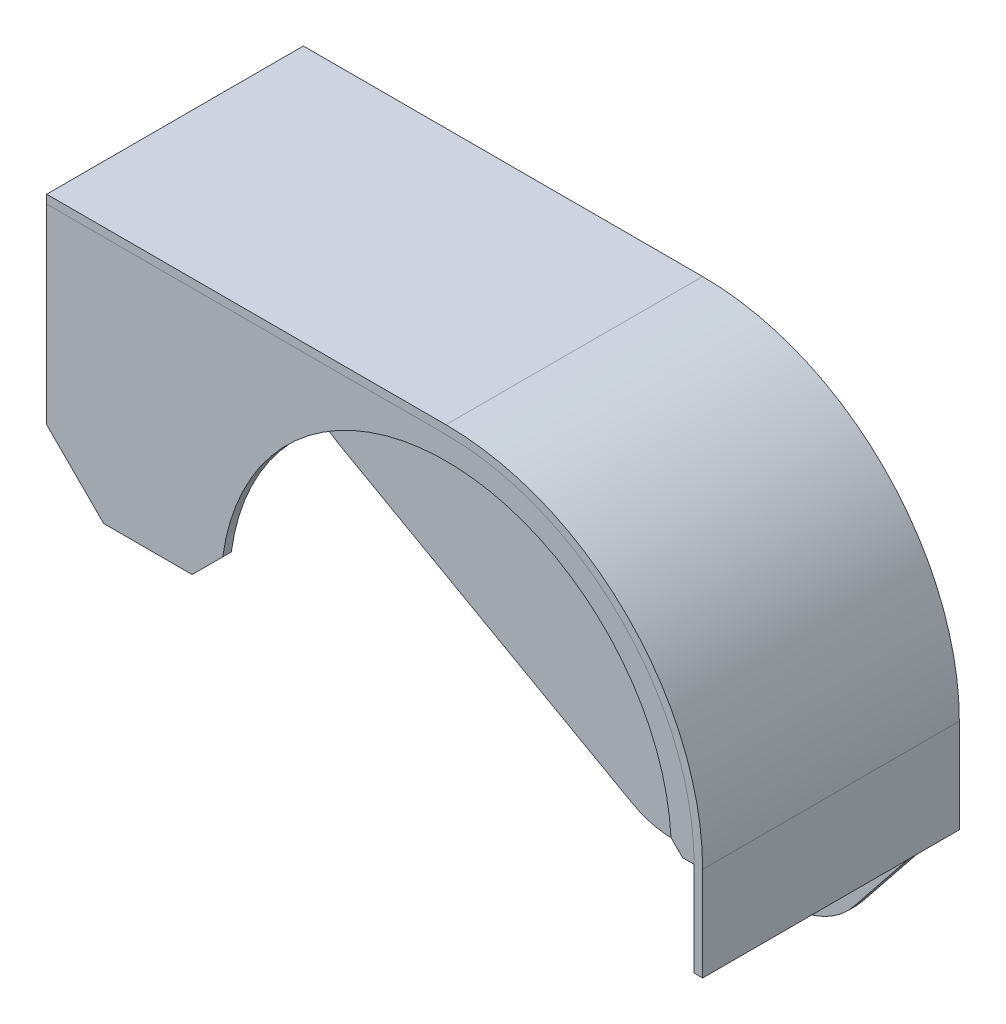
ISO-10303-21;
HEADER;
FILE_DESCRIPTION(('STEP AP214'),'2;1');
FILE_NAME('part.step','',(''),(''),'','','');
FILE_SCHEMA(('AUTOMOTIVE_DESIGN { 1 0 10303 214 1 1 1 1 }'));
ENDSEC;
DATA;
#1=APPLICATION_CONTEXT('core data for automotive mechanical design processes');
#2=APPLICATION_PROTOCOL_DEFINITION('international standard','automotive_design',2000,#1);
#3=PRODUCT_CONTEXT('',#1,'mechanical');
#4=PRODUCT('Part','Part','',(#3));
#5=PRODUCT_RELATED_PRODUCT_CATEGORY('part','',(#4));
#6=PRODUCT_DEFINITION_FORMATION('','',#4);
#7=PRODUCT_DEFINITION_CONTEXT('part definition',#1,'design');
#8=PRODUCT_DEFINITION('design','',#6,#7);
#9=PRODUCT_DEFINITION_SHAPE('','',#8);
#10=(LENGTH_UNIT() NAMED_UNIT(*) SI_UNIT(.MILLI.,.METRE.));
#11=(NAMED_UNIT(*) PLANE_ANGLE_UNIT() SI_UNIT($,.RADIAN.));
#12=(NAMED_UNIT(*) SI_UNIT($,.STERADIAN.) SOLID_ANGLE_UNIT());
#13=UNCERTAINTY_MEASURE_WITH_UNIT(LENGTH_MEASURE(1.E-05),#10,'distance_accuracy_value','');
#14=(GEOMETRIC_REPRESENTATION_CONTEXT(3) GLOBAL_UNCERTAINTY_ASSIGNED_CONTEXT((#13)) GLOBAL_UNIT_ASSIGNED_CONTEXT((#10,
#11,#12)) REPRESENTATION_CONTEXT('',''));
#15=CARTESIAN_POINT('',(0.,0.,0.));
#16=DIRECTION('',(0.,0.,1.));
#17=DIRECTION('',(1.,0.,0.));
#18=AXIS2_PLACEMENT_3D('',#15,#16,#17);
#19=CARTESIAN_POINT('',(-137.,87.,84.));
#20=DIRECTION('',(0.,0.,1.));
#21=DIRECTION('',(1.,0.,0.));
#22=AXIS2_PLACEMENT_3D('',#19,#20,#21);
#23=PLANE('',#22);
#24=DIRECTION('',(0.,1.,0.));
#25=VECTOR('',#24,1.);
#26=CARTESIAN_POINT('',(-140.,87.,84.));
#27=LINE('',#26,#25);
#28=CARTESIAN_POINT('',(-140.,62.,84.));
#29=VERTEX_POINT('',#28);
#30=CARTESIAN_POINT('',(-140.,87.,84.));
#31=VERTEX_POINT('',#30);
#32=EDGE_CURVE('E84',#29,#31,#27,.T.);
#33=ORIENTED_EDGE('',*,*,#32,.F.);
#34=DIRECTION('',(-1.,0.,0.));
#35=VECTOR('',#34,1.);
#36=CARTESIAN_POINT('',(-137.,62.,84.));
#37=LINE('',#36,#35);
#38=CARTESIAN_POINT('',(-137.,62.,84.));
#39=VERTEX_POINT('',#38);
#40=EDGE_CURVE('E12',#39,#29,#37,.T.);
#41=ORIENTED_EDGE('',*,*,#40,.F.);
#42=DIRECTION('',(0.,1.,0.));
#43=VECTOR('',#42,1.);
#44=CARTESIAN_POINT('',(-137.,87.,84.));
#45=LINE('',#44,#43);
#46=CARTESIAN_POINT('',(-137.,87.,84.));
#47=VERTEX_POINT('',#46);
#48=EDGE_CURVE('E86',#39,#47,#45,.T.);
#49=ORIENTED_EDGE('',*,*,#48,.T.);
#50=DIRECTION('',(-1.,0.,0.));
#51=VECTOR('',#50,1.);
#52=CARTESIAN_POINT('',(-137.,87.,84.));
#53=LINE('',#52,#51);
#54=EDGE_CURVE('E47',#47,#31,#53,.T.);
#55=ORIENTED_EDGE('',*,*,#54,.T.);
#56=EDGE_LOOP('',(#33,#41,#49,#55));
#57=FACE_BOUND('',#56,.T.);
#58=ADVANCED_FACE('F44',(#57),#23,.T.);
#59=CARTESIAN_POINT('',(-137.,62.,84.));
#60=DIRECTION('',(0.,-1.,0.));
#61=DIRECTION('',(0.,0.,-1.));
#62=AXIS2_PLACEMENT_3D('',#59,#60,#61);
#63=PLANE('',#62);
#64=DIRECTION('',(0.,0.,1.));
#65=VECTOR('',#64,1.);
#66=CARTESIAN_POINT('',(-140.,62.,84.));
#67=LINE('',#66,#65);
#68=CARTESIAN_POINT('',(-140.,62.,0.));
#69=VERTEX_POINT('',#68);
#70=EDGE_CURVE('E101',#69,#29,#67,.T.);
#71=ORIENTED_EDGE('',*,*,#70,.F.);
#72=DIRECTION('',(-1.,0.,0.));
#73=VECTOR('',#72,1.);
#74=CARTESIAN_POINT('',(-137.,62.,0.));
#75=LINE('',#74,#73);
#76=CARTESIAN_POINT('',(-137.,62.,0.));
#77=VERTEX_POINT('',#76);
#78=EDGE_CURVE('E52',#77,#69,#75,.T.);
#79=ORIENTED_EDGE('',*,*,#78,.F.);
#80=DIRECTION('',(0.,0.,1.));
#81=VECTOR('',#80,1.);
#82=CARTESIAN_POINT('',(-137.,62.,84.));
#83=LINE('',#82,#81);
#84=EDGE_CURVE('E91',#77,#39,#83,.T.);
#85=ORIENTED_EDGE('',*,*,#84,.T.);
#86=ORIENTED_EDGE('',*,*,#40,.T.);
#87=EDGE_LOOP('',(#71,#79,#85,#86));
#88=FACE_BOUND('',#87,.T.);
#89=ADVANCED_FACE('F116',(#88),#63,.T.);
#90=CARTESIAN_POINT('',(-137.,87.,0.));
#91=DIRECTION('',(0.,0.,-1.));
#92=DIRECTION('',(-1.,0.,0.));
#93=AXIS2_PLACEMENT_3D('',#90,#91,#92);
#94=PLANE('',#93);
#95=DIRECTION('',(0.,-1.,0.));
#96=VECTOR('',#95,1.);
#97=CARTESIAN_POINT('',(-140.,87.,0.));
#98=LINE('',#97,#96);
#99=CARTESIAN_POINT('',(-140.,87.,0.));
#100=VERTEX_POINT('',#99);
#101=EDGE_CURVE('E98',#100,#69,#98,.T.);
#102=ORIENTED_EDGE('',*,*,#101,.F.);
#103=DIRECTION('',(-1.,0.,0.));
#104=VECTOR('',#103,1.);
#105=CARTESIAN_POINT('',(-137.,87.,0.));
#106=LINE('',#105,#104);
#107=CARTESIAN_POINT('',(-137.,87.,0.));
#108=VERTEX_POINT('',#107);
#109=EDGE_CURVE('E90',#108,#100,#106,.T.);
#110=ORIENTED_EDGE('',*,*,#109,.F.);
#111=DIRECTION('',(0.,-1.,0.));
#112=VECTOR('',#111,1.);
#113=CARTESIAN_POINT('',(-137.,87.,0.));
#114=LINE('',#113,#112);
#115=EDGE_CURVE('E109',#108,#77,#114,.T.);
#116=ORIENTED_EDGE('',*,*,#115,.T.);
#117=ORIENTED_EDGE('',*,*,#78,.T.);
#118=EDGE_LOOP('',(#102,#110,#116,#117));
#119=FACE_BOUND('',#118,.T.);
#120=ADVANCED_FACE('F113',(#119),#94,.T.);
#121=CARTESIAN_POINT('',(-137.,87.,84.));
#122=DIRECTION('',(0.,1.,0.));
#123=DIRECTION('',(0.,0.,1.));
#124=AXIS2_PLACEMENT_3D('',#121,#122,#123);
#125=PLANE('',#124);
#126=DIRECTION('',(0.,0.,-1.));
#127=VECTOR('',#126,1.);
#128=CARTESIAN_POINT('',(-140.,87.,84.));
#129=LINE('',#128,#127);
#130=EDGE_CURVE('E93',#31,#100,#129,.T.);
#131=ORIENTED_EDGE('',*,*,#130,.F.);
#132=ORIENTED_EDGE('',*,*,#54,.F.);
#133=DIRECTION('',(0.,0.,-1.));
#134=VECTOR('',#133,1.);
#135=CARTESIAN_POINT('',(-137.,87.,84.));
#136=LINE('',#135,#134);
#137=EDGE_CURVE('E107',#47,#108,#136,.T.);
#138=ORIENTED_EDGE('',*,*,#137,.T.);
#139=ORIENTED_EDGE('',*,*,#109,.T.);
#140=EDGE_LOOP('',(#131,#132,#138,#139));
#141=FACE_BOUND('',#140,.T.);
#142=ADVANCED_FACE('F94',(#141),#125,.T.);
#143=CARTESIAN_POINT('',(-137.,62.,84.));
#144=DIRECTION('',(1.,0.,0.));
#145=DIRECTION('',(0.,0.,-1.));
#146=AXIS2_PLACEMENT_3D('',#143,#144,#145);
#147=PLANE('',#146);
#148=ORIENTED_EDGE('',*,*,#48,.F.);
#149=ORIENTED_EDGE('',*,*,#84,.F.);
#150=ORIENTED_EDGE('',*,*,#115,.F.);
#151=ORIENTED_EDGE('',*,*,#137,.F.);
#152=EDGE_LOOP('',(#148,#149,#150,#151));
#153=FACE_BOUND('',#152,.T.);
#154=ADVANCED_FACE('F118',(#153),#147,.T.);
#155=CARTESIAN_POINT('',(-140.,62.,84.));
#156=DIRECTION('',(1.,0.,0.));
#157=DIRECTION('',(0.,0.,-1.));
#158=AXIS2_PLACEMENT_3D('',#155,#156,#157);
#159=PLANE('',#158);
#160=ORIENTED_EDGE('',*,*,#32,.T.);
#161=ORIENTED_EDGE('',*,*,#130,.T.);
#162=ORIENTED_EDGE('',*,*,#101,.T.);
#163=ORIENTED_EDGE('',*,*,#70,.T.);
#164=EDGE_LOOP('',(#160,#161,#162,#163));
#165=FACE_BOUND('',#164,.T.);
#166=ADVANCED_FACE('F100',(#165),#159,.F.);
#167=CLOSED_SHELL('',(#58,#89,#120,#142,#154,#166));
#168=MANIFOLD_SOLID_BREP('B2',#167);
#169=CARTESIAN_POINT('',(0.,0.,84.));
#170=DIRECTION('',(0.,0.,1.));
#171=DIRECTION('',(1.,0.,0.));
#172=AXIS2_PLACEMENT_3D('',#169,#170,#171);
#173=CYLINDRICAL_SURFACE('',#172,87.);
#174=CARTESIAN_POINT('',(0.,0.,87.));
#175=DIRECTION('',(0.,0.,1.));
#176=DIRECTION('',(1.,0.,0.));
#177=AXIS2_PLACEMENT_3D('',#174,#175,#176);
#178=CIRCLE('',#177,87.);
#179=CARTESIAN_POINT('',(87.,0.,87.));
#180=VERTEX_POINT('',#179);
#181=CARTESIAN_POINT('',(0.,87.,87.));
#182=VERTEX_POINT('',#181);
#183=EDGE_CURVE('E250',#180,#182,#178,.T.);
#184=ORIENTED_EDGE('',*,*,#183,.F.);
#185=DIRECTION('',(0.,0.,1.));
#186=VECTOR('',#185,1.);
#187=CARTESIAN_POINT('',(87.,0.,84.));
#188=LINE('',#187,#186);
#189=CARTESIAN_POINT('',(87.,0.,84.));
#190=VERTEX_POINT('',#189);
#191=EDGE_CURVE('E291',#190,#180,#188,.T.);
#192=ORIENTED_EDGE('',*,*,#191,.F.);
#193=CARTESIAN_POINT('',(0.,0.,84.));
#194=DIRECTION('',(0.,0.,1.));
#195=DIRECTION('',(1.,0.,0.));
#196=AXIS2_PLACEMENT_3D('',#193,#194,#195);
#197=CIRCLE('',#196,87.);
#198=CARTESIAN_POINT('',(0.,87.,84.));
#199=VERTEX_POINT('',#198);
#200=EDGE_CURVE('E252',#190,#199,#197,.T.);
#201=ORIENTED_EDGE('',*,*,#200,.T.);
#202=DIRECTION('',(0.,0.,1.));
#203=VECTOR('',#202,1.);
#204=CARTESIAN_POINT('',(0.,87.,84.));
#205=LINE('',#204,#203);
#206=EDGE_CURVE('E246',#199,#182,#205,.T.);
#207=ORIENTED_EDGE('',*,*,#206,.T.);
#208=EDGE_LOOP('',(#184,#192,#201,#207));
#209=FACE_BOUND('',#208,.T.);
#210=ADVANCED_FACE('F178',(#209),#173,.T.);
#211=CARTESIAN_POINT('',(79.,0.,84.));
#212=DIRECTION('',(0.,-1.,0.));
#213=DIRECTION('',(1.,0.,0.));
#214=AXIS2_PLACEMENT_3D('',#211,#212,#213);
#215=PLANE('',#214);
#216=DIRECTION('',(1.,0.,0.));
#217=VECTOR('',#216,1.);
#218=CARTESIAN_POINT('',(79.,0.,87.));
#219=LINE('',#218,#217);
#220=CARTESIAN_POINT('',(83.,0.,87.));
#221=VERTEX_POINT('',#220);
#222=EDGE_CURVE('E267',#221,#180,#219,.T.);
#223=ORIENTED_EDGE('',*,*,#222,.F.);
#224=DIRECTION('',(0.,0.,-1.));
#225=VECTOR('',#224,1.);
#226=CARTESIAN_POINT('',(83.,0.,84.));
#227=LINE('',#226,#225);
#228=CARTESIAN_POINT('',(83.,0.,84.));
#229=VERTEX_POINT('',#228);
#230=EDGE_CURVE('E185',#221,#229,#227,.T.);
#231=ORIENTED_EDGE('',*,*,#230,.T.);
#232=DIRECTION('',(1.,0.,0.));
#233=VECTOR('',#232,1.);
#234=CARTESIAN_POINT('',(79.,0.,84.));
#235=LINE('',#234,#233);
#236=EDGE_CURVE('E257',#229,#190,#235,.T.);
#237=ORIENTED_EDGE('',*,*,#236,.T.);
#238=ORIENTED_EDGE('',*,*,#191,.T.);
#239=EDGE_LOOP('',(#223,#231,#237,#238));
#240=FACE_BOUND('',#239,.T.);
#241=ADVANCED_FACE('F349',(#240),#215,.T.);
#242=CARTESIAN_POINT('',(0.,0.,84.));
#243=DIRECTION('',(0.,0.,1.));
#244=DIRECTION('',(1.,0.,0.));
#245=AXIS2_PLACEMENT_3D('',#242,#243,#244);
#246=CYLINDRICAL_SURFACE('',#245,79.);
#247=CARTESIAN_POINT('',(0.,0.,84.));
#248=DIRECTION('',(0.,0.,-1.));
#249=DIRECTION('',(1.,0.,0.));
#250=AXIS2_PLACEMENT_3D('',#247,#248,#249);
#251=CIRCLE('',#250,79.);
#252=CARTESIAN_POINT('',(-78.2675880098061,10.732411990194,84.));
#253=VERTEX_POINT('',#252);
#254=CARTESIAN_POINT('',(78.8931811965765,4.10681880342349,84.));
#255=VERTEX_POINT('',#254);
#256=EDGE_CURVE('E287',#253,#255,#251,.T.);
#257=ORIENTED_EDGE('',*,*,#256,.T.);
#258=DIRECTION('',(0.,0.,1.));
#259=VECTOR('',#258,1.);
#260=CARTESIAN_POINT('',(78.8931811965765,4.10681880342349,84.));
#261=LINE('',#260,#259);
#262=CARTESIAN_POINT('',(78.8931811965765,4.10681880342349,87.));
#263=VERTEX_POINT('',#262);
#264=EDGE_CURVE('E312',#255,#263,#261,.T.);
#265=ORIENTED_EDGE('',*,*,#264,.T.);
#266=CARTESIAN_POINT('',(0.,0.,87.));
#267=DIRECTION('',(0.,0.,-1.));
#268=DIRECTION('',(1.,0.,0.));
#269=AXIS2_PLACEMENT_3D('',#266,#267,#268);
#270=CIRCLE('',#269,79.);
#271=CARTESIAN_POINT('',(-78.2675880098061,10.732411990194,87.));
#272=VERTEX_POINT('',#271);
#273=EDGE_CURVE('E275',#272,#263,#270,.T.);
#274=ORIENTED_EDGE('',*,*,#273,.F.);
#275=DIRECTION('',(0.,0.,1.));
#276=VECTOR('',#275,1.);
#277=CARTESIAN_POINT('',(-78.2675880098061,10.732411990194,84.));
#278=LINE('',#277,#276);
#279=EDGE_CURVE('E308',#272,#253,#278,.F.);
#280=ORIENTED_EDGE('',*,*,#279,.T.);
#281=EDGE_LOOP('',(#257,#265,#274,#280));
#282=FACE_BOUND('',#281,.T.);
#283=ADVANCED_FACE('F318',(#282),#246,.F.);
#284=CARTESIAN_POINT('',(-79.,0.,84.));
#285=DIRECTION('',(0.,-1.,0.));
#286=DIRECTION('',(1.,0.,0.));
#287=AXIS2_PLACEMENT_3D('',#284,#285,#286);
#288=PLANE('',#287);
#289=DIRECTION('',(1.,0.,0.));
#290=VECTOR('',#289,1.);
#291=CARTESIAN_POINT('',(-79.,0.,84.));
#292=LINE('',#291,#290);
#293=CARTESIAN_POINT('',(-120.,0.,84.));
#294=VERTEX_POINT('',#293);
#295=CARTESIAN_POINT('',(-89.,0.,84.));
#296=VERTEX_POINT('',#295);
#297=EDGE_CURVE('E284',#294,#296,#292,.T.);
#298=ORIENTED_EDGE('',*,*,#297,.T.);
#299=DIRECTION('',(0.,0.,1.));
#300=VECTOR('',#299,1.);
#301=CARTESIAN_POINT('',(-89.,0.,84.));
#302=LINE('',#301,#300);
#303=CARTESIAN_POINT('',(-89.,0.,87.));
#304=VERTEX_POINT('',#303);
#305=EDGE_CURVE('E303',#296,#304,#302,.T.);
#306=ORIENTED_EDGE('',*,*,#305,.T.);
#307=DIRECTION('',(1.,0.,0.));
#308=VECTOR('',#307,1.);
#309=CARTESIAN_POINT('',(-79.,0.,87.));
#310=LINE('',#309,#308);
#311=CARTESIAN_POINT('',(-120.,0.,87.));
#312=VERTEX_POINT('',#311);
#313=EDGE_CURVE('E272',#312,#304,#310,.T.);
#314=ORIENTED_EDGE('',*,*,#313,.F.);
#315=DIRECTION('',(0.,0.,-1.));
#316=VECTOR('',#315,1.);
#317=CARTESIAN_POINT('',(-120.,0.,84.));
#318=LINE('',#317,#316);
#319=EDGE_CURVE('E299',#312,#294,#318,.T.);
#320=ORIENTED_EDGE('',*,*,#319,.T.);
#321=EDGE_LOOP('',(#298,#306,#314,#320));
#322=FACE_BOUND('',#321,.T.);
#323=ADVANCED_FACE('F329',(#322),#288,.T.);
#324=CARTESIAN_POINT('',(-140.,87.,84.));
#325=DIRECTION('',(-1.,0.,0.));
#326=DIRECTION('',(0.,0.,1.));
#327=AXIS2_PLACEMENT_3D('',#324,#325,#326);
#328=PLANE('',#327);
#329=DIRECTION('',(0.,-1.,0.));
#330=VECTOR('',#329,1.);
#331=CARTESIAN_POINT('',(-140.,87.,84.));
#332=LINE('',#331,#330);
#333=CARTESIAN_POINT('',(-140.,87.,84.));
#334=VERTEX_POINT('',#333);
#335=CARTESIAN_POINT('',(-140.,19.9999999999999,84.));
#336=VERTEX_POINT('',#335);
#337=EDGE_CURVE('E281',#334,#336,#332,.T.);
#338=ORIENTED_EDGE('',*,*,#337,.T.);
#339=DIRECTION('',(0.,0.,1.));
#340=VECTOR('',#339,1.);
#341=CARTESIAN_POINT('',(-140.,19.9999999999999,84.));
#342=LINE('',#341,#340);
#343=CARTESIAN_POINT('',(-140.,19.9999999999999,87.));
#344=VERTEX_POINT('',#343);
#345=EDGE_CURVE('E293',#336,#344,#342,.T.);
#346=ORIENTED_EDGE('',*,*,#345,.T.);
#347=DIRECTION('',(0.,-1.,0.));
#348=VECTOR('',#347,1.);
#349=CARTESIAN_POINT('',(-140.,87.,87.));
#350=LINE('',#349,#348);
#351=CARTESIAN_POINT('',(-140.,87.,87.));
#352=VERTEX_POINT('',#351);
#353=EDGE_CURVE('E264',#352,#344,#350,.T.);
#354=ORIENTED_EDGE('',*,*,#353,.F.);
#355=DIRECTION('',(0.,0.,1.));
#356=VECTOR('',#355,1.);
#357=CARTESIAN_POINT('',(-140.,87.,84.));
#358=LINE('',#357,#356);
#359=EDGE_CURVE('E256',#334,#352,#358,.T.);
#360=ORIENTED_EDGE('',*,*,#359,.F.);
#361=EDGE_LOOP('',(#338,#346,#354,#360));
#362=FACE_BOUND('',#361,.T.);
#363=ADVANCED_FACE('F340',(#362),#328,.T.);
#364=CARTESIAN_POINT('',(0.,87.,84.));
#365=DIRECTION('',(0.,1.,0.));
#366=DIRECTION('',(0.,0.,1.));
#367=AXIS2_PLACEMENT_3D('',#364,#365,#366);
#368=PLANE('',#367);
#369=DIRECTION('',(-1.,0.,0.));
#370=VECTOR('',#369,1.);
#371=CARTESIAN_POINT('',(0.,87.,87.));
#372=LINE('',#371,#370);
#373=EDGE_CURVE('E260',#182,#352,#372,.T.);
#374=ORIENTED_EDGE('',*,*,#373,.F.);
#375=ORIENTED_EDGE('',*,*,#206,.F.);
#376=DIRECTION('',(-1.,0.,0.));
#377=VECTOR('',#376,1.);
#378=CARTESIAN_POINT('',(0.,87.,84.));
#379=LINE('',#378,#377);
#380=EDGE_CURVE('E279',#199,#334,#379,.T.);
#381=ORIENTED_EDGE('',*,*,#380,.T.);
#382=ORIENTED_EDGE('',*,*,#359,.T.);
#383=EDGE_LOOP('',(#374,#375,#381,#382));
#384=FACE_BOUND('',#383,.T.);
#385=ADVANCED_FACE('F261',(#384),#368,.T.);
#386=CARTESIAN_POINT('',(0.,0.,84.));
#387=DIRECTION('',(0.,0.,1.));
#388=DIRECTION('',(1.,0.,0.));
#389=AXIS2_PLACEMENT_3D('',#386,#387,#388);
#390=PLANE('',#389);
#391=ORIENTED_EDGE('',*,*,#236,.F.);
#392=DIRECTION('',(0.70710678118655,-0.707106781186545,0.));
#393=VECTOR('',#392,1.);
#394=CARTESIAN_POINT('',(78.8931811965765,4.10681880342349,84.));
#395=LINE('',#394,#393);
#396=EDGE_CURVE('E42',#229,#255,#395,.F.);
#397=ORIENTED_EDGE('',*,*,#396,.T.);
#398=ORIENTED_EDGE('',*,*,#256,.F.);
#399=DIRECTION('',(0.707106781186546,0.707106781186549,0.));
#400=VECTOR('',#399,1.);
#401=CARTESIAN_POINT('',(-89.,0.,84.));
#402=LINE('',#401,#400);
#403=EDGE_CURVE('E310',#253,#296,#402,.F.);
#404=ORIENTED_EDGE('',*,*,#403,.T.);
#405=ORIENTED_EDGE('',*,*,#297,.F.);
#406=DIRECTION('',(0.707106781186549,-0.707106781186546,0.));
#407=VECTOR('',#406,1.);
#408=CARTESIAN_POINT('',(-140.,19.9999999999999,84.));
#409=LINE('',#408,#407);
#410=EDGE_CURVE('E301',#294,#336,#409,.F.);
#411=ORIENTED_EDGE('',*,*,#410,.T.);
#412=ORIENTED_EDGE('',*,*,#337,.F.);
#413=ORIENTED_EDGE('',*,*,#380,.F.);
#414=ORIENTED_EDGE('',*,*,#200,.F.);
#415=EDGE_LOOP('',(#391,#397,#398,#404,#405,#411,#412,#413,#414));
#416=FACE_BOUND('',#415,.T.);
#417=ADVANCED_FACE('F334',(#416),#390,.F.);
#418=CARTESIAN_POINT('',(0.,0.,87.));
#419=DIRECTION('',(0.,0.,1.));
#420=DIRECTION('',(1.,0.,0.));
#421=AXIS2_PLACEMENT_3D('',#418,#419,#420);
#422=PLANE('',#421);
#423=ORIENTED_EDGE('',*,*,#273,.T.);
#424=DIRECTION('',(-0.70710678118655,0.707106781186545,0.));
#425=VECTOR('',#424,1.);
#426=CARTESIAN_POINT('',(41.4999999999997,41.5,87.));
#427=LINE('',#426,#425);
#428=EDGE_CURVE('E199',#263,#221,#427,.F.);
#429=ORIENTED_EDGE('',*,*,#428,.T.);
#430=ORIENTED_EDGE('',*,*,#222,.T.);
#431=ORIENTED_EDGE('',*,*,#183,.T.);
#432=ORIENTED_EDGE('',*,*,#373,.T.);
#433=ORIENTED_EDGE('',*,*,#353,.T.);
#434=DIRECTION('',(-0.707106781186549,0.707106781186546,0.));
#435=VECTOR('',#434,1.);
#436=CARTESIAN_POINT('',(-59.9999999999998,-60.,87.));
#437=LINE('',#436,#435);
#438=EDGE_CURVE('E297',#344,#312,#437,.F.);
#439=ORIENTED_EDGE('',*,*,#438,.T.);
#440=ORIENTED_EDGE('',*,*,#313,.T.);
#441=DIRECTION('',(-0.707106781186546,-0.707106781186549,0.));
#442=VECTOR('',#441,1.);
#443=CARTESIAN_POINT('',(-44.5000000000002,44.5,87.));
#444=LINE('',#443,#442);
#445=EDGE_CURVE('E306',#304,#272,#444,.F.);
#446=ORIENTED_EDGE('',*,*,#445,.T.);
#447=EDGE_LOOP('',(#423,#429,#430,#431,#432,#433,#439,#440,#446));
#448=FACE_BOUND('',#447,.T.);
#449=ADVANCED_FACE('F266',(#448),#422,.T.);
#450=CARTESIAN_POINT('',(-140.,19.9999999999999,84.));
#451=DIRECTION('',(0.707106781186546,0.707106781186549,0.));
#452=DIRECTION('',(-0.707106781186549,0.707106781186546,0.));
#453=AXIS2_PLACEMENT_3D('',#450,#451,#452);
#454=PLANE('',#453);
#455=ORIENTED_EDGE('',*,*,#410,.F.);
#456=ORIENTED_EDGE('',*,*,#319,.F.);
#457=ORIENTED_EDGE('',*,*,#438,.F.);
#458=ORIENTED_EDGE('',*,*,#345,.F.);
#459=EDGE_LOOP('',(#455,#456,#457,#458));
#460=FACE_BOUND('',#459,.T.);
#461=ADVANCED_FACE('F338',(#460),#454,.F.);
#462=CARTESIAN_POINT('',(-89.,0.,84.));
#463=DIRECTION('',(-0.707106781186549,0.707106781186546,0.));
#464=DIRECTION('',(-0.707106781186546,-0.707106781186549,0.));
#465=AXIS2_PLACEMENT_3D('',#462,#463,#464);
#466=PLANE('',#465);
#467=ORIENTED_EDGE('',*,*,#403,.F.);
#468=ORIENTED_EDGE('',*,*,#279,.F.);
#469=ORIENTED_EDGE('',*,*,#445,.F.);
#470=ORIENTED_EDGE('',*,*,#305,.F.);
#471=EDGE_LOOP('',(#467,#468,#469,#470));
#472=FACE_BOUND('',#471,.T.);
#473=ADVANCED_FACE('F327',(#472),#466,.F.);
#474=CARTESIAN_POINT('',(78.8931811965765,4.10681880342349,84.));
#475=DIRECTION('',(0.707106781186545,0.70710678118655,0.));
#476=DIRECTION('',(-0.70710678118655,0.707106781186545,0.));
#477=AXIS2_PLACEMENT_3D('',#474,#475,#476);
#478=PLANE('',#477);
#479=ORIENTED_EDGE('',*,*,#396,.F.);
#480=ORIENTED_EDGE('',*,*,#230,.F.);
#481=ORIENTED_EDGE('',*,*,#428,.F.);
#482=ORIENTED_EDGE('',*,*,#264,.F.);
#483=EDGE_LOOP('',(#479,#480,#481,#482));
#484=FACE_BOUND('',#483,.T.);
#485=ADVANCED_FACE('F341',(#484),#478,.F.);
#486=CLOSED_SHELL('',(#210,#241,#283,#323,#363,#385,#417,#449,#461,#473,#485));
#487=MANIFOLD_SOLID_BREP('B6',#486);
#488=CARTESIAN_POINT('',(0.,0.,87.));
#489=DIRECTION('',(0.,0.,-1.));
#490=DIRECTION('',(-1.,0.,0.));
#491=AXIS2_PLACEMENT_3D('',#488,#489,#490);
#492=CYLINDRICAL_SURFACE('',#491,87.);
#493=CARTESIAN_POINT('',(0.,0.,-3.));
#494=DIRECTION('',(0.,0.,1.));
#495=DIRECTION('',(-1.,0.,0.));
#496=AXIS2_PLACEMENT_3D('',#493,#494,#495);
#497=CIRCLE('',#496,87.);
#498=CARTESIAN_POINT('',(87.,0.,-3.));
#499=VERTEX_POINT('',#498);
#500=CARTESIAN_POINT('',(0.,87.,-3.));
#501=VERTEX_POINT('',#500);
#502=EDGE_CURVE('E505',#499,#501,#497,.T.);
#503=ORIENTED_EDGE('',*,*,#502,.F.);
#504=DIRECTION('',(0.,0.,-1.));
#505=VECTOR('',#504,1.);
#506=CARTESIAN_POINT('',(87.,0.,87.));
#507=LINE('',#506,#505);
#508=CARTESIAN_POINT('',(87.,0.,87.));
#509=VERTEX_POINT('',#508);
#510=EDGE_CURVE('E176',#509,#499,#507,.T.);
#511=ORIENTED_EDGE('',*,*,#510,.F.);
#512=CARTESIAN_POINT('',(0.,0.,87.));
#513=DIRECTION('',(0.,0.,1.));
#514=DIRECTION('',(-1.,0.,0.));
#515=AXIS2_PLACEMENT_3D('',#512,#513,#514);
#516=CIRCLE('',#515,87.);
#517=CARTESIAN_POINT('',(0.,87.,87.));
#518=VERTEX_POINT('',#517);
#519=EDGE_CURVE('E507',#509,#518,#516,.T.);
#520=ORIENTED_EDGE('',*,*,#519,.T.);
#521=DIRECTION('',(0.,0.,-1.));
#522=VECTOR('',#521,1.);
#523=CARTESIAN_POINT('',(0.,87.,87.));
#524=LINE('',#523,#522);
#525=EDGE_CURVE('E444',#518,#501,#524,.T.);
#526=ORIENTED_EDGE('',*,*,#525,.T.);
#527=EDGE_LOOP('',(#503,#511,#520,#526));
#528=FACE_BOUND('',#527,.T.);
#529=ADVANCED_FACE('F441',(#528),#492,.F.);
#530=CARTESIAN_POINT('',(87.,-33.,87.));
#531=DIRECTION('',(-1.,0.,0.));
#532=DIRECTION('',(0.,-1.,0.));
#533=AXIS2_PLACEMENT_3D('',#530,#531,#532);
#534=PLANE('',#533);
#535=DIRECTION('',(0.,1.,0.));
#536=VECTOR('',#535,1.);
#537=CARTESIAN_POINT('',(87.,-33.,-3.));
#538=LINE('',#537,#536);
#539=CARTESIAN_POINT('',(87.,-33.,-3.));
#540=VERTEX_POINT('',#539);
#541=EDGE_CURVE('E523',#540,#499,#538,.T.);
#542=ORIENTED_EDGE('',*,*,#541,.F.);
#543=DIRECTION('',(0.,0.,-1.));
#544=VECTOR('',#543,1.);
#545=CARTESIAN_POINT('',(87.,-33.,87.));
#546=LINE('',#545,#544);
#547=CARTESIAN_POINT('',(87.,-33.,87.));
#548=VERTEX_POINT('',#547);
#549=EDGE_CURVE('E449',#548,#540,#546,.T.);
#550=ORIENTED_EDGE('',*,*,#549,.F.);
#551=DIRECTION('',(0.,1.,0.));
#552=VECTOR('',#551,1.);
#553=CARTESIAN_POINT('',(87.,-33.,87.));
#554=LINE('',#553,#552);
#555=EDGE_CURVE('E512',#548,#509,#554,.T.);
#556=ORIENTED_EDGE('',*,*,#555,.T.);
#557=ORIENTED_EDGE('',*,*,#510,.T.);
#558=EDGE_LOOP('',(#542,#550,#556,#557));
#559=FACE_BOUND('',#558,.T.);
#560=ADVANCED_FACE('F584',(#559),#534,.T.);
#561=CARTESIAN_POINT('',(90.,-33.,87.));
#562=DIRECTION('',(0.,-1.,0.));
#563=DIRECTION('',(0.,0.,-1.));
#564=AXIS2_PLACEMENT_3D('',#561,#562,#563);
#565=PLANE('',#564);
#566=DIRECTION('',(-1.,0.,0.));
#567=VECTOR('',#566,1.);
#568=CARTESIAN_POINT('',(90.,-33.,-3.));
#569=LINE('',#568,#567);
#570=CARTESIAN_POINT('',(90.,-33.,-3.));
#571=VERTEX_POINT('',#570);
#572=EDGE_CURVE('E536',#571,#540,#569,.T.);
#573=ORIENTED_EDGE('',*,*,#572,.F.);
#574=DIRECTION('',(0.,0.,-1.));
#575=VECTOR('',#574,1.);
#576=CARTESIAN_POINT('',(90.,-33.,87.));
#577=LINE('',#576,#575);
#578=CARTESIAN_POINT('',(90.,-33.,87.));
#579=VERTEX_POINT('',#578);
#580=EDGE_CURVE('E558',#579,#571,#577,.T.);
#581=ORIENTED_EDGE('',*,*,#580,.F.);
#582=DIRECTION('',(-1.,0.,0.));
#583=VECTOR('',#582,1.);
#584=CARTESIAN_POINT('',(90.,-33.,87.));
#585=LINE('',#584,#583);
#586=EDGE_CURVE('E554',#579,#548,#585,.T.);
#587=ORIENTED_EDGE('',*,*,#586,.T.);
#588=ORIENTED_EDGE('',*,*,#549,.T.);
#589=EDGE_LOOP('',(#573,#581,#587,#588));
#590=FACE_BOUND('',#589,.T.);
#591=ADVANCED_FACE('F583',(#590),#565,.T.);
#592=CARTESIAN_POINT('',(90.0000000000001,-6.28466640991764E-13,87.));
#593=DIRECTION('',(1.,0.,0.));
#594=DIRECTION('',(0.,1.,0.));
#595=AXIS2_PLACEMENT_3D('',#592,#593,#594);
#596=PLANE('',#595);
#597=DIRECTION('',(0.,-1.,0.));
#598=VECTOR('',#597,1.);
#599=CARTESIAN_POINT('',(90.0000000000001,-6.28466640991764E-13,-3.));
#600=LINE('',#599,#598);
#601=CARTESIAN_POINT('',(90.,-5.88498612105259E-13,-3.));
#602=VERTEX_POINT('',#601);
#603=EDGE_CURVE('E533',#602,#571,#600,.T.);
#604=ORIENTED_EDGE('',*,*,#603,.F.);
#605=DIRECTION('',(0.,0.,-1.));
#606=VECTOR('',#605,1.);
#607=CARTESIAN_POINT('',(90.,-5.88498612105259E-13,87.));
#608=LINE('',#607,#606);
#609=CARTESIAN_POINT('',(90.,-5.88498612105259E-13,87.));
#610=VERTEX_POINT('',#609);
#611=EDGE_CURVE('E560',#610,#602,#608,.T.);
#612=ORIENTED_EDGE('',*,*,#611,.F.);
#613=DIRECTION('',(0.,-1.,0.));
#614=VECTOR('',#613,1.);
#615=CARTESIAN_POINT('',(90.0000000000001,-6.28466640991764E-13,87.));
#616=LINE('',#615,#614);
#617=EDGE_CURVE('E551',#610,#579,#616,.T.);
#618=ORIENTED_EDGE('',*,*,#617,.T.);
#619=ORIENTED_EDGE('',*,*,#580,.T.);
#620=EDGE_LOOP('',(#604,#612,#618,#619));
#621=FACE_BOUND('',#620,.T.);
#622=ADVANCED_FACE('F579',(#621),#596,.T.);
#623=CARTESIAN_POINT('',(0.,0.,87.));
#624=DIRECTION('',(0.,0.,-1.));
#625=DIRECTION('',(-1.,0.,0.));
#626=AXIS2_PLACEMENT_3D('',#623,#624,#625);
#627=CYLINDRICAL_SURFACE('',#626,90.);
#628=CARTESIAN_POINT('',(0.,0.,-3.));
#629=DIRECTION('',(0.,0.,-1.));
#630=DIRECTION('',(-1.,0.,0.));
#631=AXIS2_PLACEMENT_3D('',#628,#629,#630);
#632=CIRCLE('',#631,90.);
#633=CARTESIAN_POINT('',(0.,90.,-3.));
#634=VERTEX_POINT('',#633);
#635=EDGE_CURVE('E530',#634,#602,#632,.T.);
#636=ORIENTED_EDGE('',*,*,#635,.F.);
#637=DIRECTION('',(0.,0.,-1.));
#638=VECTOR('',#637,1.);
#639=CARTESIAN_POINT('',(0.,90.,87.));
#640=LINE('',#639,#638);
#641=CARTESIAN_POINT('',(0.,90.,87.));
#642=VERTEX_POINT('',#641);
#643=EDGE_CURVE('E562',#642,#634,#640,.T.);
#644=ORIENTED_EDGE('',*,*,#643,.F.);
#645=CARTESIAN_POINT('',(0.,0.,87.));
#646=DIRECTION('',(0.,0.,-1.));
#647=DIRECTION('',(-1.,0.,0.));
#648=AXIS2_PLACEMENT_3D('',#645,#646,#647);
#649=CIRCLE('',#648,90.);
#650=EDGE_CURVE('E548',#642,#610,#649,.T.);
#651=ORIENTED_EDGE('',*,*,#650,.T.);
#652=ORIENTED_EDGE('',*,*,#611,.T.);
#653=EDGE_LOOP('',(#636,#644,#651,#652));
#654=FACE_BOUND('',#653,.T.);
#655=ADVANCED_FACE('F575',(#654),#627,.T.);
#656=CARTESIAN_POINT('',(0.,90.,87.));
#657=DIRECTION('',(0.,1.,0.));
#658=DIRECTION('',(-1.,0.,0.));
#659=AXIS2_PLACEMENT_3D('',#656,#657,#658);
#660=PLANE('',#659);
#661=DIRECTION('',(1.,0.,0.));
#662=VECTOR('',#661,1.);
#663=CARTESIAN_POINT('',(0.,90.,-3.));
#664=LINE('',#663,#662);
#665=CARTESIAN_POINT('',(-140.,90.,-3.));
#666=VERTEX_POINT('',#665);
#667=EDGE_CURVE('E527',#666,#634,#664,.T.);
#668=ORIENTED_EDGE('',*,*,#667,.F.);
#669=DIRECTION('',(0.,0.,-1.));
#670=VECTOR('',#669,1.);
#671=CARTESIAN_POINT('',(-140.,90.,87.));
#672=LINE('',#671,#670);
#673=CARTESIAN_POINT('',(-140.,90.,87.));
#674=VERTEX_POINT('',#673);
#675=EDGE_CURVE('E564',#674,#666,#672,.T.);
#676=ORIENTED_EDGE('',*,*,#675,.F.);
#677=DIRECTION('',(1.,0.,0.));
#678=VECTOR('',#677,1.);
#679=CARTESIAN_POINT('',(0.,90.,87.));
#680=LINE('',#679,#678);
#681=EDGE_CURVE('E545',#674,#642,#680,.T.);
#682=ORIENTED_EDGE('',*,*,#681,.T.);
#683=ORIENTED_EDGE('',*,*,#643,.T.);
#684=EDGE_LOOP('',(#668,#676,#682,#683));
#685=FACE_BOUND('',#684,.T.);
#686=ADVANCED_FACE('F571',(#685),#660,.T.);
#687=CARTESIAN_POINT('',(-140.,90.,87.));
#688=DIRECTION('',(-1.,0.,0.));
#689=DIRECTION('',(0.,0.,1.));
#690=AXIS2_PLACEMENT_3D('',#687,#688,#689);
#691=PLANE('',#690);
#692=DIRECTION('',(0.,1.,0.));
#693=VECTOR('',#692,1.);
#694=CARTESIAN_POINT('',(-140.,90.,-3.));
#695=LINE('',#694,#693);
#696=CARTESIAN_POINT('',(-140.,87.,-3.));
#697=VERTEX_POINT('',#696);
#698=EDGE_CURVE('E519',#697,#666,#695,.T.);
#699=ORIENTED_EDGE('',*,*,#698,.F.);
#700=DIRECTION('',(0.,0.,-1.));
#701=VECTOR('',#700,1.);
#702=CARTESIAN_POINT('',(-140.,87.,87.));
#703=LINE('',#702,#701);
#704=CARTESIAN_POINT('',(-140.,87.,87.));
#705=VERTEX_POINT('',#704);
#706=EDGE_CURVE('E511',#705,#697,#703,.T.);
#707=ORIENTED_EDGE('',*,*,#706,.F.);
#708=DIRECTION('',(0.,1.,0.));
#709=VECTOR('',#708,1.);
#710=CARTESIAN_POINT('',(-140.,90.,87.));
#711=LINE('',#710,#709);
#712=EDGE_CURVE('E542',#705,#674,#711,.T.);
#713=ORIENTED_EDGE('',*,*,#712,.T.);
#714=ORIENTED_EDGE('',*,*,#675,.T.);
#715=EDGE_LOOP('',(#699,#707,#713,#714));
#716=FACE_BOUND('',#715,.T.);
#717=ADVANCED_FACE('F567',(#716),#691,.T.);
#718=CARTESIAN_POINT('',(0.,87.,87.));
#719=DIRECTION('',(0.,-1.,0.));
#720=DIRECTION('',(0.,0.,-1.));
#721=AXIS2_PLACEMENT_3D('',#718,#719,#720);
#722=PLANE('',#721);
#723=DIRECTION('',(-1.,0.,0.));
#724=VECTOR('',#723,1.);
#725=CARTESIAN_POINT('',(0.,87.,-3.));
#726=LINE('',#725,#724);
#727=EDGE_CURVE('E514',#501,#697,#726,.T.);
#728=ORIENTED_EDGE('',*,*,#727,.F.);
#729=ORIENTED_EDGE('',*,*,#525,.F.);
#730=DIRECTION('',(-1.,0.,0.));
#731=VECTOR('',#730,1.);
#732=CARTESIAN_POINT('',(0.,87.,87.));
#733=LINE('',#732,#731);
#734=EDGE_CURVE('E540',#518,#705,#733,.T.);
#735=ORIENTED_EDGE('',*,*,#734,.T.);
#736=ORIENTED_EDGE('',*,*,#706,.T.);
#737=EDGE_LOOP('',(#728,#729,#735,#736));
#738=FACE_BOUND('',#737,.T.);
#739=ADVANCED_FACE('F515',(#738),#722,.T.);
#740=CARTESIAN_POINT('',(0.,0.,87.));
#741=DIRECTION('',(0.,0.,-1.));
#742=DIRECTION('',(-1.,0.,0.));
#743=AXIS2_PLACEMENT_3D('',#740,#741,#742);
#744=PLANE('',#743);
#745=ORIENTED_EDGE('',*,*,#519,.F.);
#746=ORIENTED_EDGE('',*,*,#555,.F.);
#747=ORIENTED_EDGE('',*,*,#586,.F.);
#748=ORIENTED_EDGE('',*,*,#617,.F.);
#749=ORIENTED_EDGE('',*,*,#650,.F.);
#750=ORIENTED_EDGE('',*,*,#681,.F.);
#751=ORIENTED_EDGE('',*,*,#712,.F.);
#752=ORIENTED_EDGE('',*,*,#734,.F.);
#753=EDGE_LOOP('',(#745,#746,#747,#748,#749,#750,#751,#752));
#754=FACE_BOUND('',#753,.T.);
#755=ADVANCED_FACE('F587',(#754),#744,.F.);
#756=CARTESIAN_POINT('',(0.,0.,-3.));
#757=DIRECTION('',(0.,0.,-1.));
#758=DIRECTION('',(-1.,0.,0.));
#759=AXIS2_PLACEMENT_3D('',#756,#757,#758);
#760=PLANE('',#759);
#761=ORIENTED_EDGE('',*,*,#502,.T.);
#762=ORIENTED_EDGE('',*,*,#727,.T.);
#763=ORIENTED_EDGE('',*,*,#698,.T.);
#764=ORIENTED_EDGE('',*,*,#667,.T.);
#765=ORIENTED_EDGE('',*,*,#635,.T.);
#766=ORIENTED_EDGE('',*,*,#603,.T.);
#767=ORIENTED_EDGE('',*,*,#572,.T.);
#768=ORIENTED_EDGE('',*,*,#541,.T.);
#769=EDGE_LOOP('',(#761,#762,#763,#764,#765,#766,#767,#768));
#770=FACE_BOUND('',#769,.T.);
#771=ADVANCED_FACE('F521',(#770),#760,.T.);
#772=CLOSED_SHELL('',(#529,#560,#591,#622,#655,#686,#717,#739,#755,#771));
#773=MANIFOLD_SOLID_BREP('B36',#772);
#774=CARTESIAN_POINT('',(-140.,87.,-3.));
#775=DIRECTION('',(-1.,0.,0.));
#776=DIRECTION('',(0.,0.,1.));
#777=AXIS2_PLACEMENT_3D('',#774,#775,#776);
#778=PLANE('',#777);
#779=DIRECTION('',(0.,-1.,0.));
#780=VECTOR('',#779,1.);
#781=CARTESIAN_POINT('',(-140.,87.,-3.));
#782=LINE('',#781,#780);
#783=CARTESIAN_POINT('',(-140.,87.,-3.));
#784=VERTEX_POINT('',#783);
#785=CARTESIAN_POINT('',(-140.,4.58371707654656,-3.));
#786=VERTEX_POINT('',#785);
#787=EDGE_CURVE('E780',#784,#786,#782,.T.);
#788=ORIENTED_EDGE('',*,*,#787,.T.);
#789=DIRECTION('',(0.,0.,1.));
#790=VECTOR('',#789,1.);
#791=CARTESIAN_POINT('',(-140.,4.58371707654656,-3.));
#792=LINE('',#791,#790);
#793=CARTESIAN_POINT('',(-140.,4.58371707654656,0.));
#794=VERTEX_POINT('',#793);
#795=EDGE_CURVE('E439',#786,#794,#792,.T.);
#796=ORIENTED_EDGE('',*,*,#795,.T.);
#797=DIRECTION('',(0.,-1.,0.));
#798=VECTOR('',#797,1.);
#799=CARTESIAN_POINT('',(-140.,87.,0.));
#800=LINE('',#799,#798);
#801=CARTESIAN_POINT('',(-140.,87.,0.));
#802=VERTEX_POINT('',#801);
#803=EDGE_CURVE('E826',#802,#794,#800,.T.);
#804=ORIENTED_EDGE('',*,*,#803,.F.);
#805=DIRECTION('',(0.,0.,1.));
#806=VECTOR('',#805,1.);
#807=CARTESIAN_POINT('',(-140.,87.,-3.));
#808=LINE('',#807,#806);
#809=EDGE_CURVE('E796',#784,#802,#808,.T.);
#810=ORIENTED_EDGE('',*,*,#809,.F.);
#811=EDGE_LOOP('',(#788,#796,#804,#810));
#812=FACE_BOUND('',#811,.T.);
#813=ADVANCED_FACE('F669',(#812),#778,.T.);
#814=CARTESIAN_POINT('',(-140.,87.,-3.));
#815=DIRECTION('',(0.,1.,0.));
#816=DIRECTION('',(-1.,0.,0.));
#817=AXIS2_PLACEMENT_3D('',#814,#815,#816);
#818=PLANE('',#817);
#819=DIRECTION('',(-1.,0.,0.));
#820=VECTOR('',#819,1.);
#821=CARTESIAN_POINT('',(-140.,87.,0.));
#822=LINE('',#821,#820);
#823=CARTESIAN_POINT('',(0.,87.,0.));
#824=VERTEX_POINT('',#823);
#825=EDGE_CURVE('E774',#824,#802,#822,.T.);
#826=ORIENTED_EDGE('',*,*,#825,.F.);
#827=DIRECTION('',(0.,0.,1.));
#828=VECTOR('',#827,1.);
#829=CARTESIAN_POINT('',(0.,87.,-3.));
#830=LINE('',#829,#828);
#831=CARTESIAN_POINT('',(0.,87.,-3.));
#832=VERTEX_POINT('',#831);
#833=EDGE_CURVE('E799',#832,#824,#830,.T.);
#834=ORIENTED_EDGE('',*,*,#833,.F.);
#835=DIRECTION('',(-1.,0.,0.));
#836=VECTOR('',#835,1.);
#837=CARTESIAN_POINT('',(-140.,87.,-3.));
#838=LINE('',#837,#836);
#839=EDGE_CURVE('E768',#832,#784,#838,.T.);
#840=ORIENTED_EDGE('',*,*,#839,.T.);
#841=ORIENTED_EDGE('',*,*,#809,.T.);
#842=EDGE_LOOP('',(#826,#834,#840,#841));
#843=FACE_BOUND('',#842,.T.);
#844=ADVANCED_FACE('F923',(#843),#818,.T.);
#845=CARTESIAN_POINT('',(0.,0.,-3.));
#846=DIRECTION('',(0.,0.,1.));
#847=DIRECTION('',(1.,0.,0.));
#848=AXIS2_PLACEMENT_3D('',#845,#846,#847);
#849=CYLINDRICAL_SURFACE('',#848,87.);
#850=CARTESIAN_POINT('',(0.,0.,0.));
#851=DIRECTION('',(0.,0.,1.));
#852=DIRECTION('',(1.,0.,0.));
#853=AXIS2_PLACEMENT_3D('',#850,#851,#852);
#854=CIRCLE('',#853,87.);
#855=CARTESIAN_POINT('',(87.,0.,0.));
#856=VERTEX_POINT('',#855);
#857=EDGE_CURVE('E772',#856,#824,#854,.T.);
#858=ORIENTED_EDGE('',*,*,#857,.F.);
#859=DIRECTION('',(0.,0.,1.));
#860=VECTOR('',#859,1.);
#861=CARTESIAN_POINT('',(87.,0.,-3.));
#862=LINE('',#861,#860);
#863=CARTESIAN_POINT('',(87.,0.,-3.));
#864=VERTEX_POINT('',#863);
#865=EDGE_CURVE('E767',#864,#856,#862,.T.);
#866=ORIENTED_EDGE('',*,*,#865,.F.);
#867=CARTESIAN_POINT('',(0.,0.,-3.));
#868=DIRECTION('',(0.,0.,1.));
#869=DIRECTION('',(1.,0.,0.));
#870=AXIS2_PLACEMENT_3D('',#867,#868,#869);
#871=CIRCLE('',#870,87.);
#872=EDGE_CURVE('E791',#864,#832,#871,.T.);
#873=ORIENTED_EDGE('',*,*,#872,.T.);
#874=ORIENTED_EDGE('',*,*,#833,.T.);
#875=EDGE_LOOP('',(#858,#866,#873,#874));
#876=FACE_BOUND('',#875,.T.);
#877=ADVANCED_FACE('F928',(#876),#849,.T.);
#878=CARTESIAN_POINT('',(87.,0.,-3.));
#879=DIRECTION('',(1.,0.,0.));
#880=DIRECTION('',(0.,0.,-1.));
#881=AXIS2_PLACEMENT_3D('',#878,#879,#880);
#882=PLANE('',#881);
#883=DIRECTION('',(0.,1.,0.));
#884=VECTOR('',#883,1.);
#885=CARTESIAN_POINT('',(87.,0.,0.));
#886=LINE('',#885,#884);
#887=CARTESIAN_POINT('',(87.,-33.,0.));
#888=VERTEX_POINT('',#887);
#889=EDGE_CURVE('E753',#888,#856,#886,.T.);
#890=ORIENTED_EDGE('',*,*,#889,.F.);
#891=DIRECTION('',(0.,0.,1.));
#892=VECTOR('',#891,1.);
#893=CARTESIAN_POINT('',(87.,-33.,-3.));
#894=LINE('',#893,#892);
#895=CARTESIAN_POINT('',(87.,-33.,-3.));
#896=VERTEX_POINT('',#895);
#897=EDGE_CURVE('E760',#896,#888,#894,.T.);
#898=ORIENTED_EDGE('',*,*,#897,.F.);
#899=DIRECTION('',(0.,1.,0.));
#900=VECTOR('',#899,1.);
#901=CARTESIAN_POINT('',(87.,0.,-3.));
#902=LINE('',#901,#900);
#903=EDGE_CURVE('E789',#896,#864,#902,.T.);
#904=ORIENTED_EDGE('',*,*,#903,.T.);
#905=ORIENTED_EDGE('',*,*,#865,.T.);
#906=EDGE_LOOP('',(#890,#898,#904,#905));
#907=FACE_BOUND('',#906,.T.);
#908=ADVANCED_FACE('F770',(#907),#882,.T.);
#909=CARTESIAN_POINT('',(87.,-33.,-3.));
#910=DIRECTION('',(0.78086880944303,-0.624695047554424,0.));
#911=DIRECTION('',(0.624695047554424,0.78086880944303,0.));
#912=AXIS2_PLACEMENT_3D('',#909,#910,#911);
#913=PLANE('',#912);
#914=DIRECTION('',(0.624695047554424,0.78086880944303,0.));
#915=VECTOR('',#914,1.);
#916=CARTESIAN_POINT('',(87.,-33.,0.));
#917=LINE('',#916,#915);
#918=CARTESIAN_POINT('',(56.0073188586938,-71.7408514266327,0.));
#919=VERTEX_POINT('',#918);
#920=EDGE_CURVE('E747',#919,#888,#917,.T.);
#921=ORIENTED_EDGE('',*,*,#920,.F.);
#922=DIRECTION('',(0.,0.,1.));
#923=VECTOR('',#922,1.);
#924=CARTESIAN_POINT('',(56.0073188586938,-71.7408514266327,-3.));
#925=LINE('',#924,#923);
#926=CARTESIAN_POINT('',(56.0073188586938,-71.7408514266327,-3.));
#927=VERTEX_POINT('',#926);
#928=EDGE_CURVE('E811',#919,#927,#925,.F.);
#929=ORIENTED_EDGE('',*,*,#928,.T.);
#930=DIRECTION('',(0.624695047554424,0.78086880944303,0.));
#931=VECTOR('',#930,1.);
#932=CARTESIAN_POINT('',(87.,-33.,-3.));
#933=LINE('',#932,#931);
#934=EDGE_CURVE('E763',#927,#896,#933,.T.);
#935=ORIENTED_EDGE('',*,*,#934,.T.);
#936=ORIENTED_EDGE('',*,*,#897,.T.);
#937=EDGE_LOOP('',(#921,#929,#935,#936));
#938=FACE_BOUND('',#937,.T.);
#939=ADVANCED_FACE('F761',(#938),#913,.T.);
#940=CARTESIAN_POINT('',(47.,-83.,-3.));
#941=DIRECTION('',(0.,-1.,0.));
#942=DIRECTION('',(1.,0.,0.));
#943=AXIS2_PLACEMENT_3D('',#940,#941,#942);
#944=PLANE('',#943);
#945=DIRECTION('',(1.,0.,0.));
#946=VECTOR('',#945,1.);
#947=CARTESIAN_POINT('',(47.,-83.,-3.));
#948=LINE('',#947,#946);
#949=CARTESIAN_POINT('',(-7.17193379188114,-83.,-3.));
#950=VERTEX_POINT('',#949);
#951=CARTESIAN_POINT('',(32.5812545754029,-83.,-3.));
#952=VERTEX_POINT('',#951);
#953=EDGE_CURVE('E785',#950,#952,#948,.T.);
#954=ORIENTED_EDGE('',*,*,#953,.T.);
#955=DIRECTION('',(0.,0.,1.));
#956=VECTOR('',#955,1.);
#957=CARTESIAN_POINT('',(32.5812545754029,-83.,-3.));
#958=LINE('',#957,#956);
#959=CARTESIAN_POINT('',(32.5812545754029,-83.,0.));
#960=VERTEX_POINT('',#959);
#961=EDGE_CURVE('E803',#952,#960,#958,.T.);
#962=ORIENTED_EDGE('',*,*,#961,.T.);
#963=DIRECTION('',(1.,0.,0.));
#964=VECTOR('',#963,1.);
#965=CARTESIAN_POINT('',(47.,-83.,0.));
#966=LINE('',#965,#964);
#967=CARTESIAN_POINT('',(-7.17193379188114,-83.,0.));
#968=VERTEX_POINT('',#967);
#969=EDGE_CURVE('E757',#968,#960,#966,.T.);
#970=ORIENTED_EDGE('',*,*,#969,.F.);
#971=DIRECTION('',(0.,0.,1.));
#972=VECTOR('',#971,1.);
#973=CARTESIAN_POINT('',(-7.17193379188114,-83.,-3.));
#974=LINE('',#973,#972);
#975=EDGE_CURVE('E798',#968,#950,#974,.F.);
#976=ORIENTED_EDGE('',*,*,#975,.T.);
#977=EDGE_LOOP('',(#954,#962,#970,#976));
#978=FACE_BOUND('',#977,.T.);
#979=ADVANCED_FACE('F908',(#978),#944,.T.);
#980=CARTESIAN_POINT('',(-140.,-13.,-3.));
#981=DIRECTION('',(-0.488603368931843,-0.87250601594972,0.));
#982=DIRECTION('',(0.87250601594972,-0.488603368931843,0.));
#983=AXIS2_PLACEMENT_3D('',#980,#981,#982);
#984=PLANE('',#983);
#985=DIRECTION('',(0.87250601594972,-0.488603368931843,0.));
#986=VECTOR('',#985,1.);
#987=CARTESIAN_POINT('',(-140.,-13.,-3.));
#988=LINE('',#987,#986);
#989=CARTESIAN_POINT('',(-124.658101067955,-21.591463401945,-3.));
#990=VERTEX_POINT('',#989);
#991=CARTESIAN_POINT('',(-21.8300348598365,-79.1751804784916,-3.));
#992=VERTEX_POINT('',#991);
#993=EDGE_CURVE('E783',#990,#992,#988,.T.);
#994=ORIENTED_EDGE('',*,*,#993,.T.);
#995=DIRECTION('',(0.,0.,1.));
#996=VECTOR('',#995,1.);
#997=CARTESIAN_POINT('',(-21.8300348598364,-79.1751804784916,-3.));
#998=LINE('',#997,#996);
#999=CARTESIAN_POINT('',(-21.8300348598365,-79.1751804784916,0.));
#1000=VERTEX_POINT('',#999);
#1001=EDGE_CURVE('E676',#992,#1000,#998,.T.);
#1002=ORIENTED_EDGE('',*,*,#1001,.T.);
#1003=DIRECTION('',(0.87250601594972,-0.488603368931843,0.));
#1004=VECTOR('',#1003,1.);
#1005=CARTESIAN_POINT('',(-140.,-13.,0.));
#1006=LINE('',#1005,#1004);
#1007=CARTESIAN_POINT('',(-124.658101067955,-21.591463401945,0.));
#1008=VERTEX_POINT('',#1007);
#1009=EDGE_CURVE('E822',#1008,#1000,#1006,.T.);
#1010=ORIENTED_EDGE('',*,*,#1009,.F.);
#1011=DIRECTION('',(0.,0.,1.));
#1012=VECTOR('',#1011,1.);
#1013=CARTESIAN_POINT('',(-124.658101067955,-21.591463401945,-3.));
#1014=LINE('',#1013,#1012);
#1015=EDGE_CURVE('E690',#1008,#990,#1014,.F.);
#1016=ORIENTED_EDGE('',*,*,#1015,.T.);
#1017=EDGE_LOOP('',(#994,#1002,#1010,#1016));
#1018=FACE_BOUND('',#1017,.T.);
#1019=ADVANCED_FACE('F821',(#1018),#984,.T.);
#1020=CARTESIAN_POINT('',(0.,0.,-3.));
#1021=DIRECTION('',(0.,0.,1.));
#1022=DIRECTION('',(1.,0.,0.));
#1023=AXIS2_PLACEMENT_3D('',#1020,#1021,#1022);
#1024=PLANE('',#1023);
#1025=CARTESIAN_POINT('',(0.,0.,-3.));
#1026=DIRECTION('',(0.,0.,1.));
#1027=DIRECTION('',(1.,0.,0.));
#1028=AXIS2_PLACEMENT_3D('',#1025,#1026,#1027);
#1029=CIRCLE('',#1028,20.);
#1030=CARTESIAN_POINT('',(20.,0.,-3.));
#1031=VERTEX_POINT('',#1030);
#1032=EDGE_CURVE('E866',#1031,#1031,#1029,.F.);
#1033=ORIENTED_EDGE('',*,*,#1032,.F.);
#1034=EDGE_LOOP('',(#1033));
#1035=FACE_BOUND('',#1034,.T.);
#1036=CARTESIAN_POINT('',(15.0000000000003,-25.980762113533,-3.));
#1037=DIRECTION('',(0.,0.,1.));
#1038=DIRECTION('',(1.,0.,0.));
#1039=AXIS2_PLACEMENT_3D('',#1036,#1037,#1038);
#1040=CIRCLE('',#1039,3.3);
#1041=CARTESIAN_POINT('',(18.3000000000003,-25.980762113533,-3.));
#1042=VERTEX_POINT('',#1041);
#1043=EDGE_CURVE('E860',#1042,#1042,#1040,.T.);
#1044=ORIENTED_EDGE('',*,*,#1043,.T.);
#1045=EDGE_LOOP('',(#1044));
#1046=FACE_BOUND('',#1045,.T.);
#1047=CARTESIAN_POINT('',(-14.9999999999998,-25.9807621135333,-3.));
#1048=DIRECTION('',(0.,0.,1.));
#1049=DIRECTION('',(1.,0.,0.));
#1050=AXIS2_PLACEMENT_3D('',#1047,#1048,#1049);
#1051=CIRCLE('',#1050,3.3);
#1052=CARTESIAN_POINT('',(-11.6999999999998,-25.9807621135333,-3.));
#1053=VERTEX_POINT('',#1052);
#1054=EDGE_CURVE('E854',#1053,#1053,#1051,.T.);
#1055=ORIENTED_EDGE('',*,*,#1054,.T.);
#1056=EDGE_LOOP('',(#1055));
#1057=FACE_BOUND('',#1056,.T.);
#1058=CARTESIAN_POINT('',(-30.,-2.09489001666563E-13,-3.));
#1059=DIRECTION('',(0.,0.,1.));
#1060=DIRECTION('',(1.,0.,0.));
#1061=AXIS2_PLACEMENT_3D('',#1058,#1059,#1060);
#1062=CIRCLE('',#1061,3.3);
#1063=CARTESIAN_POINT('',(-26.7,-2.09489001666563E-13,-3.));
#1064=VERTEX_POINT('',#1063);
#1065=EDGE_CURVE('E848',#1064,#1064,#1062,.T.);
#1066=ORIENTED_EDGE('',*,*,#1065,.T.);
#1067=EDGE_LOOP('',(#1066));
#1068=FACE_BOUND('',#1067,.T.);
#1069=CARTESIAN_POINT('',(-15.0000000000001,25.9807621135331,-3.));
#1070=DIRECTION('',(0.,0.,1.));
#1071=DIRECTION('',(1.,0.,0.));
#1072=AXIS2_PLACEMENT_3D('',#1069,#1070,#1071);
#1073=CIRCLE('',#1072,3.3);
#1074=CARTESIAN_POINT('',(-11.7000000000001,25.9807621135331,-3.));
#1075=VERTEX_POINT('',#1074);
#1076=EDGE_CURVE('E842',#1075,#1075,#1073,.T.);
#1077=ORIENTED_EDGE('',*,*,#1076,.T.);
#1078=EDGE_LOOP('',(#1077));
#1079=FACE_BOUND('',#1078,.T.);
#1080=CARTESIAN_POINT('',(14.9999999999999,25.9807621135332,-3.));
#1081=DIRECTION('',(0.,0.,1.));
#1082=DIRECTION('',(1.,0.,0.));
#1083=AXIS2_PLACEMENT_3D('',#1080,#1081,#1082);
#1084=CIRCLE('',#1083,3.3);
#1085=CARTESIAN_POINT('',(18.2999999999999,25.9807621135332,-3.));
#1086=VERTEX_POINT('',#1085);
#1087=EDGE_CURVE('E836',#1086,#1086,#1084,.T.);
#1088=ORIENTED_EDGE('',*,*,#1087,.T.);
#1089=EDGE_LOOP('',(#1088));
#1090=FACE_BOUND('',#1089,.T.);
#1091=CARTESIAN_POINT('',(30.,0.,-3.));
#1092=DIRECTION('',(0.,0.,1.));
#1093=DIRECTION('',(1.,0.,0.));
#1094=AXIS2_PLACEMENT_3D('',#1091,#1092,#1093);
#1095=CIRCLE('',#1094,3.3);
#1096=CARTESIAN_POINT('',(33.3,0.,-3.));
#1097=VERTEX_POINT('',#1096);
#1098=EDGE_CURVE('E828',#1097,#1097,#1095,.T.);
#1099=ORIENTED_EDGE('',*,*,#1098,.T.);
#1100=EDGE_LOOP('',(#1099));
#1101=FACE_BOUND('',#1100,.T.);
#1102=ORIENTED_EDGE('',*,*,#934,.F.);
#1103=CARTESIAN_POINT('',(32.5812545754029,-53.,-3.));
#1104=DIRECTION('',(0.,0.,1.));
#1105=DIRECTION('',(1.,0.,0.));
#1106=AXIS2_PLACEMENT_3D('',#1103,#1104,#1105);
#1107=CIRCLE('',#1106,30.);
#1108=EDGE_CURVE('E816',#927,#952,#1107,.F.);
#1109=ORIENTED_EDGE('',*,*,#1108,.T.);
#1110=ORIENTED_EDGE('',*,*,#953,.F.);
#1111=CARTESIAN_POINT('',(-7.17193379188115,-53.,-3.));
#1112=DIRECTION('',(0.,0.,1.));
#1113=DIRECTION('',(1.,0.,0.));
#1114=AXIS2_PLACEMENT_3D('',#1111,#1112,#1113);
#1115=CIRCLE('',#1114,30.);
#1116=EDGE_CURVE('E683',#950,#992,#1115,.F.);
#1117=ORIENTED_EDGE('',*,*,#1116,.T.);
#1118=ORIENTED_EDGE('',*,*,#993,.F.);
#1119=CARTESIAN_POINT('',(-110.,4.58371707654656,-3.));
#1120=DIRECTION('',(0.,0.,1.));
#1121=DIRECTION('',(1.,0.,0.));
#1122=AXIS2_PLACEMENT_3D('',#1119,#1120,#1121);
#1123=CIRCLE('',#1122,30.);
#1124=EDGE_CURVE('E813',#990,#786,#1123,.F.);
#1125=ORIENTED_EDGE('',*,*,#1124,.T.);
#1126=ORIENTED_EDGE('',*,*,#787,.F.);
#1127=ORIENTED_EDGE('',*,*,#839,.F.);
#1128=ORIENTED_EDGE('',*,*,#872,.F.);
#1129=ORIENTED_EDGE('',*,*,#903,.F.);
#1130=EDGE_LOOP('',(#1102,#1109,#1110,#1117,#1118,#1125,#1126,#1127,#1128,#1129));
#1131=FACE_BOUND('',#1130,.T.);
#1132=ADVANCED_FACE('F879',(#1035,#1046,#1057,#1068,#1079,#1090,#1101,#1131),#1024,.F.);
#1133=CARTESIAN_POINT('',(0.,0.,0.));
#1134=DIRECTION('',(0.,0.,1.));
#1135=DIRECTION('',(1.,0.,0.));
#1136=AXIS2_PLACEMENT_3D('',#1133,#1134,#1135);
#1137=PLANE('',#1136);
#1138=CARTESIAN_POINT('',(0.,0.,0.));
#1139=DIRECTION('',(0.,0.,1.));
#1140=DIRECTION('',(1.,0.,0.));
#1141=AXIS2_PLACEMENT_3D('',#1138,#1139,#1140);
#1142=CIRCLE('',#1141,20.);
#1143=CARTESIAN_POINT('',(20.,0.,0.));
#1144=VERTEX_POINT('',#1143);
#1145=EDGE_CURVE('E869',#1144,#1144,#1142,.T.);
#1146=ORIENTED_EDGE('',*,*,#1145,.F.);
#1147=EDGE_LOOP('',(#1146));
#1148=FACE_BOUND('',#1147,.T.);
#1149=CARTESIAN_POINT('',(15.0000000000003,-25.980762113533,0.));
#1150=DIRECTION('',(0.,0.,1.));
#1151=DIRECTION('',(1.,0.,0.));
#1152=AXIS2_PLACEMENT_3D('',#1149,#1150,#1151);
#1153=CIRCLE('',#1152,3.3);
#1154=CARTESIAN_POINT('',(18.3000000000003,-25.980762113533,0.));
#1155=VERTEX_POINT('',#1154);
#1156=EDGE_CURVE('E863',#1155,#1155,#1153,.T.);
#1157=ORIENTED_EDGE('',*,*,#1156,.F.);
#1158=EDGE_LOOP('',(#1157));
#1159=FACE_BOUND('',#1158,.T.);
#1160=CARTESIAN_POINT('',(-14.9999999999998,-25.9807621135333,0.));
#1161=DIRECTION('',(0.,0.,1.));
#1162=DIRECTION('',(1.,0.,0.));
#1163=AXIS2_PLACEMENT_3D('',#1160,#1161,#1162);
#1164=CIRCLE('',#1163,3.3);
#1165=CARTESIAN_POINT('',(-11.6999999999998,-25.9807621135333,0.));
#1166=VERTEX_POINT('',#1165);
#1167=EDGE_CURVE('E857',#1166,#1166,#1164,.T.);
#1168=ORIENTED_EDGE('',*,*,#1167,.F.);
#1169=EDGE_LOOP('',(#1168));
#1170=FACE_BOUND('',#1169,.T.);
#1171=CARTESIAN_POINT('',(-30.,-2.09489001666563E-13,0.));
#1172=DIRECTION('',(0.,0.,1.));
#1173=DIRECTION('',(1.,0.,0.));
#1174=AXIS2_PLACEMENT_3D('',#1171,#1172,#1173);
#1175=CIRCLE('',#1174,3.3);
#1176=CARTESIAN_POINT('',(-26.7,-2.09489001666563E-13,0.));
#1177=VERTEX_POINT('',#1176);
#1178=EDGE_CURVE('E851',#1177,#1177,#1175,.T.);
#1179=ORIENTED_EDGE('',*,*,#1178,.F.);
#1180=EDGE_LOOP('',(#1179));
#1181=FACE_BOUND('',#1180,.T.);
#1182=CARTESIAN_POINT('',(-15.0000000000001,25.9807621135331,0.));
#1183=DIRECTION('',(0.,0.,1.));
#1184=DIRECTION('',(1.,0.,0.));
#1185=AXIS2_PLACEMENT_3D('',#1182,#1183,#1184);
#1186=CIRCLE('',#1185,3.3);
#1187=CARTESIAN_POINT('',(-11.7000000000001,25.9807621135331,0.));
#1188=VERTEX_POINT('',#1187);
#1189=EDGE_CURVE('E845',#1188,#1188,#1186,.T.);
#1190=ORIENTED_EDGE('',*,*,#1189,.F.);
#1191=EDGE_LOOP('',(#1190));
#1192=FACE_BOUND('',#1191,.T.);
#1193=CARTESIAN_POINT('',(14.9999999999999,25.9807621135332,0.));
#1194=DIRECTION('',(0.,0.,1.));
#1195=DIRECTION('',(1.,0.,0.));
#1196=AXIS2_PLACEMENT_3D('',#1193,#1194,#1195);
#1197=CIRCLE('',#1196,3.3);
#1198=CARTESIAN_POINT('',(18.2999999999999,25.9807621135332,0.));
#1199=VERTEX_POINT('',#1198);
#1200=EDGE_CURVE('E839',#1199,#1199,#1197,.T.);
#1201=ORIENTED_EDGE('',*,*,#1200,.F.);
#1202=EDGE_LOOP('',(#1201));
#1203=FACE_BOUND('',#1202,.T.);
#1204=CARTESIAN_POINT('',(30.,0.,0.));
#1205=DIRECTION('',(0.,0.,1.));
#1206=DIRECTION('',(1.,0.,0.));
#1207=AXIS2_PLACEMENT_3D('',#1204,#1205,#1206);
#1208=CIRCLE('',#1207,3.3);
#1209=CARTESIAN_POINT('',(33.3,0.,0.));
#1210=VERTEX_POINT('',#1209);
#1211=EDGE_CURVE('E833',#1210,#1210,#1208,.T.);
#1212=ORIENTED_EDGE('',*,*,#1211,.F.);
#1213=EDGE_LOOP('',(#1212));
#1214=FACE_BOUND('',#1213,.T.);
#1215=ORIENTED_EDGE('',*,*,#969,.T.);
#1216=CARTESIAN_POINT('',(32.5812545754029,-53.,0.));
#1217=DIRECTION('',(0.,0.,1.));
#1218=DIRECTION('',(1.,0.,0.));
#1219=AXIS2_PLACEMENT_3D('',#1216,#1217,#1218);
#1220=CIRCLE('',#1219,30.);
#1221=EDGE_CURVE('E754',#960,#919,#1220,.T.);
#1222=ORIENTED_EDGE('',*,*,#1221,.T.);
#1223=ORIENTED_EDGE('',*,*,#920,.T.);
#1224=ORIENTED_EDGE('',*,*,#889,.T.);
#1225=ORIENTED_EDGE('',*,*,#857,.T.);
#1226=ORIENTED_EDGE('',*,*,#825,.T.);
#1227=ORIENTED_EDGE('',*,*,#803,.T.);
#1228=CARTESIAN_POINT('',(-110.,4.58371707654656,0.));
#1229=DIRECTION('',(0.,0.,1.));
#1230=DIRECTION('',(1.,0.,0.));
#1231=AXIS2_PLACEMENT_3D('',#1228,#1229,#1230);
#1232=CIRCLE('',#1231,30.);
#1233=EDGE_CURVE('E806',#794,#1008,#1232,.T.);
#1234=ORIENTED_EDGE('',*,*,#1233,.T.);
#1235=ORIENTED_EDGE('',*,*,#1009,.T.);
#1236=CARTESIAN_POINT('',(-7.17193379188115,-53.,0.));
#1237=DIRECTION('',(0.,0.,1.));
#1238=DIRECTION('',(1.,0.,0.));
#1239=AXIS2_PLACEMENT_3D('',#1236,#1237,#1238);
#1240=CIRCLE('',#1239,30.);
#1241=EDGE_CURVE('E808',#1000,#968,#1240,.T.);
#1242=ORIENTED_EDGE('',*,*,#1241,.T.);
#1243=EDGE_LOOP('',(#1215,#1222,#1223,#1224,#1225,#1226,#1227,#1234,#1235,#1242));
#1244=FACE_BOUND('',#1243,.T.);
#1245=ADVANCED_FACE('F750',(#1148,#1159,#1170,#1181,#1192,#1203,#1214,#1244),#1137,.T.);
#1246=CARTESIAN_POINT('',(30.,0.,0.));
#1247=DIRECTION('',(0.,0.,1.));
#1248=DIRECTION('',(1.,0.,0.));
#1249=AXIS2_PLACEMENT_3D('',#1246,#1247,#1248);
#1250=CYLINDRICAL_SURFACE('',#1249,3.3);
#1251=ORIENTED_EDGE('',*,*,#1211,.T.);
#1252=EDGE_LOOP('',(#1251));
#1253=FACE_BOUND('',#1252,.T.);
#1254=ORIENTED_EDGE('',*,*,#1098,.F.);
#1255=EDGE_LOOP('',(#1254));
#1256=FACE_BOUND('',#1255,.T.);
#1257=ADVANCED_FACE('F878',(#1253,#1256),#1250,.F.);
#1258=CARTESIAN_POINT('',(14.9999999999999,25.9807621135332,0.));
#1259=DIRECTION('',(0.,0.,1.));
#1260=DIRECTION('',(1.,0.,0.));
#1261=AXIS2_PLACEMENT_3D('',#1258,#1259,#1260);
#1262=CYLINDRICAL_SURFACE('',#1261,3.3);
#1263=ORIENTED_EDGE('',*,*,#1200,.T.);
#1264=EDGE_LOOP('',(#1263));
#1265=FACE_BOUND('',#1264,.T.);
#1266=ORIENTED_EDGE('',*,*,#1087,.F.);
#1267=EDGE_LOOP('',(#1266));
#1268=FACE_BOUND('',#1267,.T.);
#1269=ADVANCED_FACE('F895',(#1265,#1268),#1262,.F.);
#1270=CARTESIAN_POINT('',(-15.0000000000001,25.9807621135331,0.));
#1271=DIRECTION('',(0.,0.,1.));
#1272=DIRECTION('',(1.,0.,0.));
#1273=AXIS2_PLACEMENT_3D('',#1270,#1271,#1272);
#1274=CYLINDRICAL_SURFACE('',#1273,3.3);
#1275=ORIENTED_EDGE('',*,*,#1189,.T.);
#1276=EDGE_LOOP('',(#1275));
#1277=FACE_BOUND('',#1276,.T.);
#1278=ORIENTED_EDGE('',*,*,#1076,.F.);
#1279=EDGE_LOOP('',(#1278));
#1280=FACE_BOUND('',#1279,.T.);
#1281=ADVANCED_FACE('F975',(#1277,#1280),#1274,.F.);
#1282=CARTESIAN_POINT('',(-30.,-2.09489001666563E-13,0.));
#1283=DIRECTION('',(0.,0.,1.));
#1284=DIRECTION('',(1.,0.,0.));
#1285=AXIS2_PLACEMENT_3D('',#1282,#1283,#1284);
#1286=CYLINDRICAL_SURFACE('',#1285,3.3);
#1287=ORIENTED_EDGE('',*,*,#1178,.T.);
#1288=EDGE_LOOP('',(#1287));
#1289=FACE_BOUND('',#1288,.T.);
#1290=ORIENTED_EDGE('',*,*,#1065,.F.);
#1291=EDGE_LOOP('',(#1290));
#1292=FACE_BOUND('',#1291,.T.);
#1293=ADVANCED_FACE('F983',(#1289,#1292),#1286,.F.);
#1294=CARTESIAN_POINT('',(-14.9999999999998,-25.9807621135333,0.));
#1295=DIRECTION('',(0.,0.,1.));
#1296=DIRECTION('',(1.,0.,0.));
#1297=AXIS2_PLACEMENT_3D('',#1294,#1295,#1296);
#1298=CYLINDRICAL_SURFACE('',#1297,3.3);
#1299=ORIENTED_EDGE('',*,*,#1167,.T.);
#1300=EDGE_LOOP('',(#1299));
#1301=FACE_BOUND('',#1300,.T.);
#1302=ORIENTED_EDGE('',*,*,#1054,.F.);
#1303=EDGE_LOOP('',(#1302));
#1304=FACE_BOUND('',#1303,.T.);
#1305=ADVANCED_FACE('F991',(#1301,#1304),#1298,.F.);
#1306=CARTESIAN_POINT('',(15.0000000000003,-25.980762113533,0.));
#1307=DIRECTION('',(0.,0.,1.));
#1308=DIRECTION('',(1.,0.,0.));
#1309=AXIS2_PLACEMENT_3D('',#1306,#1307,#1308);
#1310=CYLINDRICAL_SURFACE('',#1309,3.3);
#1311=ORIENTED_EDGE('',*,*,#1156,.T.);
#1312=EDGE_LOOP('',(#1311));
#1313=FACE_BOUND('',#1312,.T.);
#1314=ORIENTED_EDGE('',*,*,#1043,.F.);
#1315=EDGE_LOOP('',(#1314));
#1316=FACE_BOUND('',#1315,.T.);
#1317=ADVANCED_FACE('F920',(#1313,#1316),#1310,.F.);
#1318=CARTESIAN_POINT('',(32.5812545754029,-53.,-3.));
#1319=DIRECTION('',(0.,0.,1.));
#1320=DIRECTION('',(1.,0.,0.));
#1321=AXIS2_PLACEMENT_3D('',#1318,#1319,#1320);
#1322=CYLINDRICAL_SURFACE('',#1321,30.);
#1323=ORIENTED_EDGE('',*,*,#1108,.F.);
#1324=ORIENTED_EDGE('',*,*,#928,.F.);
#1325=ORIENTED_EDGE('',*,*,#1221,.F.);
#1326=ORIENTED_EDGE('',*,*,#961,.F.);
#1327=EDGE_LOOP('',(#1323,#1324,#1325,#1326));
#1328=FACE_BOUND('',#1327,.T.);
#1329=ADVANCED_FACE('F906',(#1328),#1322,.T.);
#1330=CARTESIAN_POINT('',(-7.17193379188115,-53.,-3.));
#1331=DIRECTION('',(0.,0.,1.));
#1332=DIRECTION('',(1.,0.,0.));
#1333=AXIS2_PLACEMENT_3D('',#1330,#1331,#1332);
#1334=CYLINDRICAL_SURFACE('',#1333,30.);
#1335=ORIENTED_EDGE('',*,*,#1116,.F.);
#1336=ORIENTED_EDGE('',*,*,#975,.F.);
#1337=ORIENTED_EDGE('',*,*,#1241,.F.);
#1338=ORIENTED_EDGE('',*,*,#1001,.F.);
#1339=EDGE_LOOP('',(#1335,#1336,#1337,#1338));
#1340=FACE_BOUND('',#1339,.T.);
#1341=ADVANCED_FACE('F910',(#1340),#1334,.T.);
#1342=CARTESIAN_POINT('',(-110.,4.58371707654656,-3.));
#1343=DIRECTION('',(0.,0.,1.));
#1344=DIRECTION('',(1.,0.,0.));
#1345=AXIS2_PLACEMENT_3D('',#1342,#1343,#1344);
#1346=CYLINDRICAL_SURFACE('',#1345,30.);
#1347=ORIENTED_EDGE('',*,*,#1124,.F.);
#1348=ORIENTED_EDGE('',*,*,#1015,.F.);
#1349=ORIENTED_EDGE('',*,*,#1233,.F.);
#1350=ORIENTED_EDGE('',*,*,#795,.F.);
#1351=EDGE_LOOP('',(#1347,#1348,#1349,#1350));
#1352=FACE_BOUND('',#1351,.T.);
#1353=ADVANCED_FACE('F912',(#1352),#1346,.T.);
#1354=CARTESIAN_POINT('',(0.,0.,-3.001));
#1355=DIRECTION('',(0.,0.,1.));
#1356=DIRECTION('',(1.,0.,0.));
#1357=AXIS2_PLACEMENT_3D('',#1354,#1355,#1356);
#1358=CYLINDRICAL_SURFACE('',#1357,20.);
#1359=CARTESIAN_POINT('',(20.,0.,0.));
#1360=CARTESIAN_POINT('',(20.,0.,-0.0312500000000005));
#1361=CARTESIAN_POINT('',(20.,0.,-0.0625000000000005));
#1362=CARTESIAN_POINT('',(20.,0.,-0.125000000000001));
#1363=CARTESIAN_POINT('',(20.,0.,-0.156250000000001));
#1364=CARTESIAN_POINT('',(20.,0.,-0.218750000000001));
#1365=CARTESIAN_POINT('',(20.,0.,-0.250000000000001));
#1366=CARTESIAN_POINT('',(20.,0.,-0.312500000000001));
#1367=CARTESIAN_POINT('',(20.,0.,-0.34375));
#1368=CARTESIAN_POINT('',(20.,0.,-0.40625));
#1369=CARTESIAN_POINT('',(20.,0.,-0.4375));
#1370=CARTESIAN_POINT('',(20.,0.,-0.5));
#1371=CARTESIAN_POINT('',(20.,0.,-0.53125));
#1372=CARTESIAN_POINT('',(20.,0.,-0.593750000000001));
#1373=CARTESIAN_POINT('',(20.,0.,-0.625000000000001));
#1374=CARTESIAN_POINT('',(20.,0.,-0.687500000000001));
#1375=CARTESIAN_POINT('',(20.,0.,-0.71875));
#1376=CARTESIAN_POINT('',(20.,0.,-0.78125));
#1377=CARTESIAN_POINT('',(20.,0.,-0.8125));
#1378=CARTESIAN_POINT('',(20.,0.,-0.875));
#1379=CARTESIAN_POINT('',(20.,0.,-0.90625));
#1380=CARTESIAN_POINT('',(20.,0.,-0.96875));
#1381=CARTESIAN_POINT('',(20.,0.,-1.));
#1382=CARTESIAN_POINT('',(20.,0.,-1.0625));
#1383=CARTESIAN_POINT('',(20.,0.,-1.09375));
#1384=CARTESIAN_POINT('',(20.,0.,-1.15625));
#1385=CARTESIAN_POINT('',(20.,0.,-1.1875));
#1386=CARTESIAN_POINT('',(20.,0.,-1.25));
#1387=CARTESIAN_POINT('',(20.,0.,-1.28125));
#1388=CARTESIAN_POINT('',(20.,0.,-1.34375));
#1389=CARTESIAN_POINT('',(20.,0.,-1.375));
#1390=CARTESIAN_POINT('',(20.,0.,-1.4375));
#1391=CARTESIAN_POINT('',(20.,0.,-1.46875));
#1392=CARTESIAN_POINT('',(20.,0.,-1.53125));
#1393=CARTESIAN_POINT('',(20.,0.,-1.5625));
#1394=CARTESIAN_POINT('',(20.,0.,-1.625));
#1395=CARTESIAN_POINT('',(20.,0.,-1.65625));
#1396=CARTESIAN_POINT('',(20.,0.,-1.71875));
#1397=CARTESIAN_POINT('',(20.,0.,-1.75));
#1398=CARTESIAN_POINT('',(20.,0.,-1.8125));
#1399=CARTESIAN_POINT('',(20.,0.,-1.84375));
#1400=CARTESIAN_POINT('',(20.,0.,-1.90625));
#1401=CARTESIAN_POINT('',(20.,0.,-1.9375));
#1402=CARTESIAN_POINT('',(20.,0.,-2.));
#1403=CARTESIAN_POINT('',(20.,0.,-2.03125));
#1404=CARTESIAN_POINT('',(20.,0.,-2.09375));
#1405=CARTESIAN_POINT('',(20.,0.,-2.125));
#1406=CARTESIAN_POINT('',(20.,0.,-2.1875));
#1407=CARTESIAN_POINT('',(20.,0.,-2.21875));
#1408=CARTESIAN_POINT('',(20.,0.,-2.28125));
#1409=CARTESIAN_POINT('',(20.,0.,-2.3125));
#1410=CARTESIAN_POINT('',(20.,0.,-2.375));
#1411=CARTESIAN_POINT('',(20.,0.,-2.40625));
#1412=CARTESIAN_POINT('',(20.,0.,-2.46875));
#1413=CARTESIAN_POINT('',(20.,0.,-2.5));
#1414=CARTESIAN_POINT('',(20.,0.,-2.5625));
#1415=CARTESIAN_POINT('',(20.,0.,-2.59375));
#1416=CARTESIAN_POINT('',(20.,0.,-2.65625));
#1417=CARTESIAN_POINT('',(20.,0.,-2.6875));
#1418=CARTESIAN_POINT('',(20.,0.,-2.75));
#1419=CARTESIAN_POINT('',(20.,0.,-2.78125));
#1420=CARTESIAN_POINT('',(20.,0.,-2.84375));
#1421=CARTESIAN_POINT('',(20.,0.,-2.875));
#1422=CARTESIAN_POINT('',(20.,0.,-2.9375));
#1423=CARTESIAN_POINT('',(20.,0.,-2.96875));
#1424=CARTESIAN_POINT('',(20.,0.,-3.));
#1425=B_SPLINE_CURVE_WITH_KNOTS('',3,(#1359,#1360,#1361,#1362,#1363,#1364,#1365,#1366,#1367,
#1368,#1369,#1370,#1371,#1372,#1373,#1374,#1375,#1376,#1377,#1378,#1379,#1380,#1381,#1382,#1383,
#1384,#1385,#1386,#1387,#1388,#1389,#1390,#1391,#1392,#1393,#1394,#1395,#1396,#1397,#1398,#1399,
#1400,#1401,#1402,#1403,#1404,#1405,#1406,#1407,#1408,#1409,#1410,#1411,#1412,#1413,#1414,#1415,
#1416,#1417,#1418,#1419,#1420,#1421,#1422,#1423,#1424),.UNSPECIFIED.,.F.,.F.,(4,2,2,2,2,2,2,2,2,
2,2,2,2,2,2,2,2,2,2,2,2,2,2,2,2,2,2,2,2,2,2,2,4),(0.,0.0937500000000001,0.1875,0.28125,0.375,
0.46875,0.5625,0.65625,0.75,0.84375,0.9375,1.03125,1.125,1.21875,1.3125,1.40625,1.5,1.59375,
1.6875,1.78125,1.875,1.96875,2.0625,2.15625,2.25,2.34375,2.4375,2.53125,2.625,2.71875,2.8125,
2.90625,3.),.UNSPECIFIED.);
#1426=EDGE_CURVE('BSEAM873',#1144,#1031,#1425,.T.);
#1427=ORIENTED_EDGE('',*,*,#1145,.T.);
#1428=ORIENTED_EDGE('',*,*,#1032,.T.);
#1429=ORIENTED_EDGE('',*,*,#1426,.T.);
#1430=ORIENTED_EDGE('',*,*,#1426,.F.);
#1431=EDGE_LOOP('',(#1427,#1429,#1428,#1430));
#1432=FACE_BOUND('',#1431,.T.);
#1433=ADVANCED_FACE('F873',(#1432),#1358,.F.);
#1434=CLOSED_SHELL('',(#813,#844,#877,#908,#939,#979,#1019,#1132,#1245,#1257,#1269,#1281,#1293,
#1305,#1317,#1329,#1341,#1353,#1433));
#1435=MANIFOLD_SOLID_BREP('B170',#1434);
#1436=ADVANCED_BREP_SHAPE_REPRESENTATION('',(#18,#168,#487,#773,#1435),#14);
#1437=SHAPE_DEFINITION_REPRESENTATION(#9,#1436);
ENDSEC;
END-ISO-10303-21;
